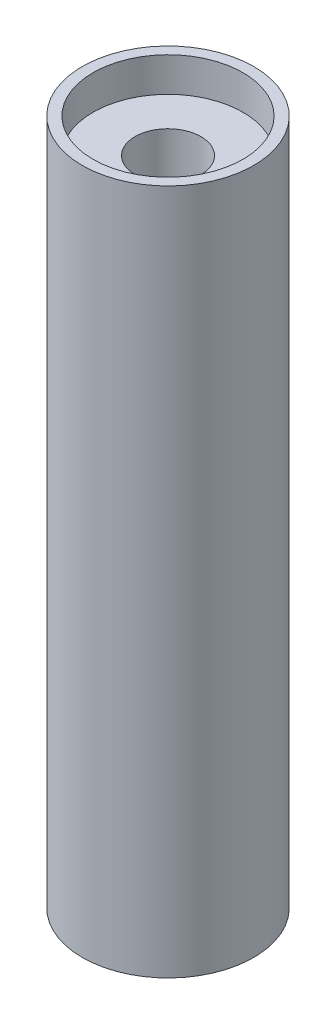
ISO-10303-21;
HEADER;
FILE_DESCRIPTION(('STEP AP214'),'2;1');
FILE_NAME('part.step','',(''),(''),'','','');
FILE_SCHEMA(('AUTOMOTIVE_DESIGN { 1 0 10303 214 1 1 1 1 }'));
ENDSEC;
DATA;
#1=APPLICATION_CONTEXT('core data for automotive mechanical design processes');
#2=APPLICATION_PROTOCOL_DEFINITION('international standard','automotive_design',2000,#1);
#3=PRODUCT_CONTEXT('',#1,'mechanical');
#4=PRODUCT('Part','Part','',(#3));
#5=PRODUCT_RELATED_PRODUCT_CATEGORY('part','',(#4));
#6=PRODUCT_DEFINITION_FORMATION('','',#4);
#7=PRODUCT_DEFINITION_CONTEXT('part definition',#1,'design');
#8=PRODUCT_DEFINITION('design','',#6,#7);
#9=PRODUCT_DEFINITION_SHAPE('','',#8);
#10=(LENGTH_UNIT() NAMED_UNIT(*) SI_UNIT(.MILLI.,.METRE.));
#11=(NAMED_UNIT(*) PLANE_ANGLE_UNIT() SI_UNIT($,.RADIAN.));
#12=(NAMED_UNIT(*) SI_UNIT($,.STERADIAN.) SOLID_ANGLE_UNIT());
#13=UNCERTAINTY_MEASURE_WITH_UNIT(LENGTH_MEASURE(1.E-05),#10,'distance_accuracy_value','');
#14=(GEOMETRIC_REPRESENTATION_CONTEXT(3) GLOBAL_UNCERTAINTY_ASSIGNED_CONTEXT((#13)) GLOBAL_UNIT_ASSIGNED_CONTEXT((#10,
#11,#12)) REPRESENTATION_CONTEXT('',''));
#15=CARTESIAN_POINT('',(0.,0.,0.));
#16=DIRECTION('',(0.,0.,1.));
#17=DIRECTION('',(1.,0.,0.));
#18=AXIS2_PLACEMENT_3D('',#15,#16,#17);
#19=CARTESIAN_POINT('',(0.,25.4,0.));
#20=DIRECTION('',(0.,-1.,0.));
#21=DIRECTION('',(0.,0.,-1.));
#22=AXIS2_PLACEMENT_3D('',#19,#20,#21);
#23=CYLINDRICAL_SURFACE('',#22,3.175);
#24=CARTESIAN_POINT('',(0.,25.4,0.));
#25=DIRECTION('',(0.,1.,0.));
#26=DIRECTION('',(0.,0.,1.));
#27=AXIS2_PLACEMENT_3D('',#24,#25,#26);
#28=CIRCLE('',#27,3.175);
#29=CARTESIAN_POINT('',(0.,25.4,3.175));
#30=VERTEX_POINT('',#29);
#31=EDGE_CURVE('E11',#30,#30,#28,.T.);
#32=ORIENTED_EDGE('',*,*,#31,.F.);
#33=EDGE_LOOP('',(#32));
#34=FACE_BOUND('',#33,.T.);
#35=CARTESIAN_POINT('',(0.,0.,0.));
#36=DIRECTION('',(0.,1.,0.));
#37=DIRECTION('',(0.,0.,1.));
#38=AXIS2_PLACEMENT_3D('',#35,#36,#37);
#39=CIRCLE('',#38,3.175);
#40=CARTESIAN_POINT('',(0.,0.,3.175));
#41=VERTEX_POINT('',#40);
#42=EDGE_CURVE('E48',#41,#41,#39,.T.);
#43=ORIENTED_EDGE('',*,*,#42,.T.);
#44=EDGE_LOOP('',(#43));
#45=FACE_BOUND('',#44,.T.);
#46=ADVANCED_FACE('F45',(#34,#45),#23,.T.);
#47=CARTESIAN_POINT('',(0.,25.4,0.));
#48=DIRECTION('',(0.,1.,0.));
#49=DIRECTION('',(0.,0.,1.));
#50=AXIS2_PLACEMENT_3D('',#47,#48,#49);
#51=PLANE('',#50);
#52=CARTESIAN_POINT('',(0.,25.4,0.));
#53=DIRECTION('',(0.,1.,0.));
#54=DIRECTION('',(0.,0.,1.));
#55=AXIS2_PLACEMENT_3D('',#52,#53,#54);
#56=CIRCLE('',#55,2.77876);
#57=CARTESIAN_POINT('',(0.,25.4,2.77876));
#58=VERTEX_POINT('',#57);
#59=EDGE_CURVE('E207',#58,#58,#56,.T.);
#60=ORIENTED_EDGE('',*,*,#59,.F.);
#61=EDGE_LOOP('',(#60));
#62=FACE_BOUND('',#61,.T.);
#63=ORIENTED_EDGE('',*,*,#31,.T.);
#64=EDGE_LOOP('',(#63));
#65=FACE_BOUND('',#64,.T.);
#66=ADVANCED_FACE('F103',(#62,#65),#51,.T.);
#67=CARTESIAN_POINT('',(0.,0.,0.));
#68=DIRECTION('',(0.,1.,0.));
#69=DIRECTION('',(0.,0.,1.));
#70=AXIS2_PLACEMENT_3D('',#67,#68,#69);
#71=PLANE('',#70);
#72=CARTESIAN_POINT('',(0.,0.,0.));
#73=DIRECTION('',(0.,-1.,0.));
#74=DIRECTION('',(0.,0.,-1.));
#75=AXIS2_PLACEMENT_3D('',#72,#73,#74);
#76=CIRCLE('',#75,1.5875);
#77=CARTESIAN_POINT('',(0.,0.,-1.5875));
#78=VERTEX_POINT('',#77);
#79=EDGE_CURVE('E70',#78,#78,#76,.T.);
#80=ORIENTED_EDGE('',*,*,#79,.F.);
#81=EDGE_LOOP('',(#80));
#82=FACE_BOUND('',#81,.T.);
#83=ORIENTED_EDGE('',*,*,#42,.F.);
#84=EDGE_LOOP('',(#83));
#85=FACE_BOUND('',#84,.T.);
#86=ADVANCED_FACE('F100',(#82,#85),#71,.F.);
#87=CARTESIAN_POINT('',(0.,6.35,0.));
#88=DIRECTION('',(0.,-1.,0.));
#89=DIRECTION('',(0.,0.,-1.));
#90=AXIS2_PLACEMENT_3D('',#87,#88,#89);
#91=CONICAL_SURFACE('',#90,0.698499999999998,1.02974425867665);
#92=CARTESIAN_POINT('',(0.,6.76970114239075,0.));
#93=VERTEX_POINT('',#92);
#94=VERTEX_LOOP('',#93);
#95=FACE_BOUND('',#94,.T.);
#96=CARTESIAN_POINT('',(0.,6.35,0.));
#97=DIRECTION('',(0.,-1.,0.));
#98=DIRECTION('',(0.,0.,-1.));
#99=AXIS2_PLACEMENT_3D('',#96,#97,#98);
#100=CIRCLE('',#99,0.698499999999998);
#101=CARTESIAN_POINT('',(0.,6.35,-0.698499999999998));
#102=VERTEX_POINT('',#101);
#103=EDGE_CURVE('E90',#102,#102,#100,.T.);
#104=ORIENTED_EDGE('',*,*,#103,.T.);
#105=EDGE_LOOP('',(#104));
#106=FACE_BOUND('',#105,.T.);
#107=ADVANCED_FACE('F102',(#95,#106),#91,.F.);
#108=CARTESIAN_POINT('',(0.,0.,0.));
#109=DIRECTION('',(0.,-1.,0.));
#110=DIRECTION('',(0.,0.,-1.));
#111=AXIS2_PLACEMENT_3D('',#108,#109,#110);
#112=CYLINDRICAL_SURFACE('',#111,0.698499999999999);
#113=ORIENTED_EDGE('',*,*,#103,.F.);
#114=EDGE_LOOP('',(#113));
#115=FACE_BOUND('',#114,.T.);
#116=CARTESIAN_POINT('',(0.,0.711199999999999,0.));
#117=DIRECTION('',(0.,-1.,0.));
#118=DIRECTION('',(0.,0.,-1.));
#119=AXIS2_PLACEMENT_3D('',#116,#117,#118);
#120=CIRCLE('',#119,0.698499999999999);
#121=CARTESIAN_POINT('',(0.,0.711199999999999,-0.698499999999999));
#122=VERTEX_POINT('',#121);
#123=EDGE_CURVE('E86',#122,#122,#120,.T.);
#124=ORIENTED_EDGE('',*,*,#123,.T.);
#125=EDGE_LOOP('',(#124));
#126=FACE_BOUND('',#125,.T.);
#127=ADVANCED_FACE('F109',(#115,#126),#112,.F.);
#128=CARTESIAN_POINT('',(0.698499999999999,0.7112,0.));
#129=DIRECTION('',(0.,1.,0.));
#130=DIRECTION('',(0.,0.,1.));
#131=AXIS2_PLACEMENT_3D('',#128,#129,#130);
#132=PLANE('',#131);
#133=ORIENTED_EDGE('',*,*,#123,.F.);
#134=EDGE_LOOP('',(#133));
#135=FACE_BOUND('',#134,.T.);
#136=CARTESIAN_POINT('',(0.,0.7112,0.));
#137=DIRECTION('',(0.,-1.,0.));
#138=DIRECTION('',(0.,0.,-1.));
#139=AXIS2_PLACEMENT_3D('',#136,#137,#138);
#140=CIRCLE('',#139,1.5875);
#141=CARTESIAN_POINT('',(0.,0.7112,-1.5875));
#142=VERTEX_POINT('',#141);
#143=EDGE_CURVE('E76',#142,#142,#140,.T.);
#144=ORIENTED_EDGE('',*,*,#143,.T.);
#145=EDGE_LOOP('',(#144));
#146=FACE_BOUND('',#145,.T.);
#147=ADVANCED_FACE('F147',(#135,#146),#132,.F.);
#148=CARTESIAN_POINT('',(0.,0.,0.));
#149=DIRECTION('',(0.,-1.,0.));
#150=DIRECTION('',(0.,0.,-1.));
#151=AXIS2_PLACEMENT_3D('',#148,#149,#150);
#152=CYLINDRICAL_SURFACE('',#151,1.5875);
#153=ORIENTED_EDGE('',*,*,#143,.F.);
#154=EDGE_LOOP('',(#153));
#155=FACE_BOUND('',#154,.T.);
#156=ORIENTED_EDGE('',*,*,#79,.T.);
#157=EDGE_LOOP('',(#156));
#158=FACE_BOUND('',#157,.T.);
#159=ADVANCED_FACE('F63',(#155,#158),#152,.F.);
#160=CARTESIAN_POINT('',(0.,19.05,0.));
#161=DIRECTION('',(0.,1.,0.));
#162=DIRECTION('',(0.,0.,1.));
#163=AXIS2_PLACEMENT_3D('',#160,#161,#162);
#164=CONICAL_SURFACE('',#163,1.2192,1.02974425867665);
#165=CARTESIAN_POINT('',(0.,18.3174307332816,0.));
#166=VERTEX_POINT('',#165);
#167=VERTEX_LOOP('',#166);
#168=FACE_BOUND('',#167,.T.);
#169=CARTESIAN_POINT('',(0.,19.05,0.));
#170=DIRECTION('',(0.,1.,0.));
#171=DIRECTION('',(0.,0.,1.));
#172=AXIS2_PLACEMENT_3D('',#169,#170,#171);
#173=CIRCLE('',#172,1.2192);
#174=CARTESIAN_POINT('',(0.,19.05,1.2192));
#175=VERTEX_POINT('',#174);
#176=EDGE_CURVE('E67',#175,#175,#173,.T.);
#177=ORIENTED_EDGE('',*,*,#176,.T.);
#178=EDGE_LOOP('',(#177));
#179=FACE_BOUND('',#178,.T.);
#180=ADVANCED_FACE('F59',(#168,#179),#164,.F.);
#181=CARTESIAN_POINT('',(0.,25.4,0.));
#182=DIRECTION('',(0.,1.,0.));
#183=DIRECTION('',(0.,0.,1.));
#184=AXIS2_PLACEMENT_3D('',#181,#182,#183);
#185=CYLINDRICAL_SURFACE('',#184,1.2192);
#186=ORIENTED_EDGE('',*,*,#176,.F.);
#187=EDGE_LOOP('',(#186));
#188=FACE_BOUND('',#187,.T.);
#189=CARTESIAN_POINT('',(0.,24.13,0.));
#190=DIRECTION('',(0.,1.,0.));
#191=DIRECTION('',(0.,0.,1.));
#192=AXIS2_PLACEMENT_3D('',#189,#190,#191);
#193=CIRCLE('',#192,1.2192);
#194=CARTESIAN_POINT('',(0.,24.13,1.2192));
#195=VERTEX_POINT('',#194);
#196=EDGE_CURVE('E71',#195,#195,#193,.T.);
#197=ORIENTED_EDGE('',*,*,#196,.T.);
#198=EDGE_LOOP('',(#197));
#199=FACE_BOUND('',#198,.T.);
#200=ADVANCED_FACE('F62',(#188,#199),#185,.F.);
#201=CARTESIAN_POINT('',(1.2192,24.13,0.));
#202=DIRECTION('',(0.,-1.,0.));
#203=DIRECTION('',(0.,0.,-1.));
#204=AXIS2_PLACEMENT_3D('',#201,#202,#203);
#205=PLANE('',#204);
#206=ORIENTED_EDGE('',*,*,#196,.F.);
#207=EDGE_LOOP('',(#206));
#208=FACE_BOUND('',#207,.T.);
#209=CARTESIAN_POINT('',(0.,24.13,0.));
#210=DIRECTION('',(0.,1.,0.));
#211=DIRECTION('',(0.,0.,1.));
#212=AXIS2_PLACEMENT_3D('',#209,#210,#211);
#213=CIRCLE('',#212,2.77876);
#214=CARTESIAN_POINT('',(0.,24.13,2.77876));
#215=VERTEX_POINT('',#214);
#216=EDGE_CURVE('E79',#215,#215,#213,.T.);
#217=ORIENTED_EDGE('',*,*,#216,.T.);
#218=EDGE_LOOP('',(#217));
#219=FACE_BOUND('',#218,.T.);
#220=ADVANCED_FACE('F180',(#208,#219),#205,.F.);
#221=CARTESIAN_POINT('',(0.,25.4,0.));
#222=DIRECTION('',(0.,1.,0.));
#223=DIRECTION('',(0.,0.,1.));
#224=AXIS2_PLACEMENT_3D('',#221,#222,#223);
#225=CYLINDRICAL_SURFACE('',#224,2.77876);
#226=ORIENTED_EDGE('',*,*,#216,.F.);
#227=EDGE_LOOP('',(#226));
#228=FACE_BOUND('',#227,.T.);
#229=ORIENTED_EDGE('',*,*,#59,.T.);
#230=EDGE_LOOP('',(#229));
#231=FACE_BOUND('',#230,.T.);
#232=ADVANCED_FACE('F189',(#228,#231),#225,.F.);
#233=CLOSED_SHELL('',(#46,#66,#86,#107,#127,#147,#159,#180,#200,#220,#232));
#234=MANIFOLD_SOLID_BREP('B2',#233);
#235=ADVANCED_BREP_SHAPE_REPRESENTATION('',(#18,#234),#14);
#236=SHAPE_DEFINITION_REPRESENTATION(#9,#235);
ENDSEC;
END-ISO-10303-21;
